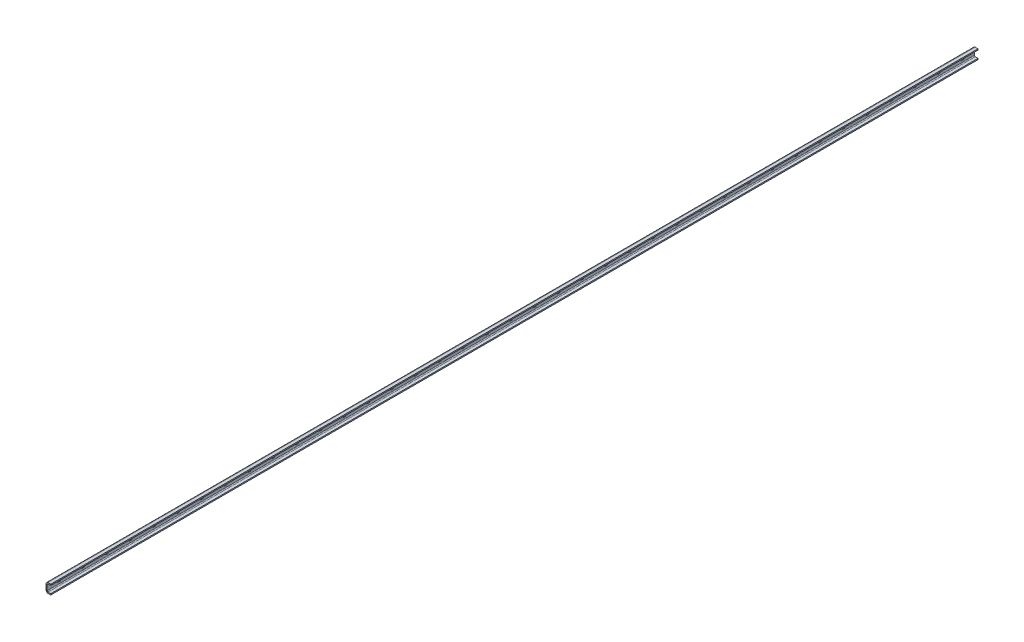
from build123d import *

# Parameters (mm, degrees)
EXTRUDE1_DEPTH  = 3120
EXTRUDE2_DEPTH  = 3121.063590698
LPATTERN1_COUNT = 39
LPATTERN1_PITCH = 80


with BuildPart() as part:
    # Sketch1 → Extrude1 (new body)
    with BuildSketch(Plane.XY):
        with BuildLine():
            Line((16, 11.9), (16, 15.9))
            Line((16, 15.9), (7, 15.9))
            ThreePointArc((7, 15.9), (2.050252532, 13.849747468), (0, 8.9))
            Line((0, 8.9), (0, -8.9))
            ThreePointArc((0, -8.9), (2.050252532, -13.849747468), (7, -15.9))
            Line((7, -15.9), (16, -15.9))
            Line((16, -15.9), (16, -11.9))
            Line((16, -11.9), (7, -11.9))
            ThreePointArc((7, -11.9), (4.878679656, -11.021320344), (4, -8.9))
            Line((4, -8.9), (4, 8.9))
            ThreePointArc((4, 8.9), (4.878679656, 11.021320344), (7, 11.9))
            Line((7, 11.9), (16, 11.9))
        make_face()
    extrude(amount=-EXTRUDE1_DEPTH)

    # Sketch2 → Extrude2 (cut, through all)
    with BuildSketch(Plane(origin=(4, 0, 0), x_dir=(0, 0, -1), z_dir=(1, 0, 0))):
        with BuildLine():
            Line((37.5, 3), (42.5, 3))
            ThreePointArc((42.5, 3), (45.5, 0), (42.5, -3))
            Line((42.5, -3), (37.5, -3))
            ThreePointArc((37.5, -3), (34.5, 0), (37.5, 3))
        make_face()
    extrude2 = extrude(amount=-EXTRUDE2_DEPTH, mode=Mode.SUBTRACT)

    # LPattern1: Extrude2 ×39
    with Locations(*[(0, 0, -i * LPATTERN1_PITCH) for i in range(1, LPATTERN1_COUNT)]):
        add(extrude2, mode=Mode.SUBTRACT)


solid = part.part
